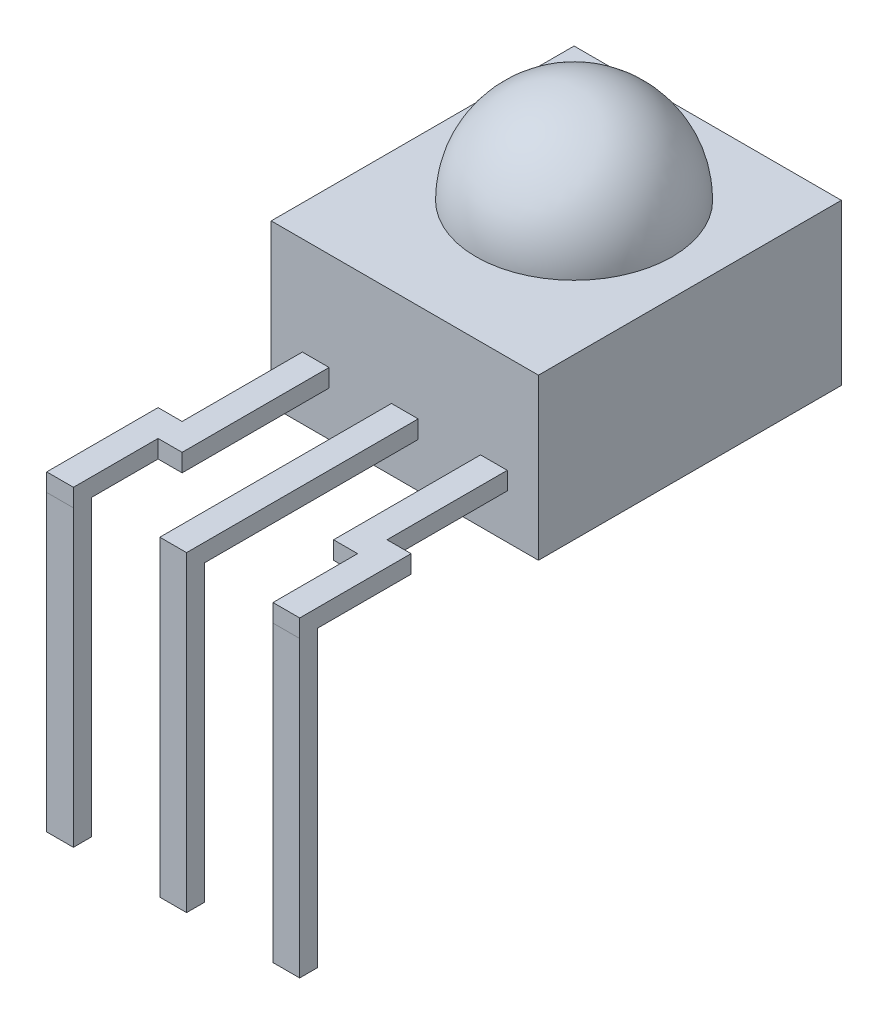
ISO-10303-21;
HEADER;
FILE_DESCRIPTION(('STEP AP214'),'2;1');
FILE_NAME('part.step','',(''),(''),'','','');
FILE_SCHEMA(('AUTOMOTIVE_DESIGN { 1 0 10303 214 1 1 1 1 }'));
ENDSEC;
DATA;
#1=APPLICATION_CONTEXT('core data for automotive mechanical design processes');
#2=APPLICATION_PROTOCOL_DEFINITION('international standard','automotive_design',2000,#1);
#3=PRODUCT_CONTEXT('',#1,'mechanical');
#4=PRODUCT('Part','Part','',(#3));
#5=PRODUCT_RELATED_PRODUCT_CATEGORY('part','',(#4));
#6=PRODUCT_DEFINITION_FORMATION('','',#4);
#7=PRODUCT_DEFINITION_CONTEXT('part definition',#1,'design');
#8=PRODUCT_DEFINITION('design','',#6,#7);
#9=PRODUCT_DEFINITION_SHAPE('','',#8);
#10=(LENGTH_UNIT() NAMED_UNIT(*) SI_UNIT(.MILLI.,.METRE.));
#11=(NAMED_UNIT(*) PLANE_ANGLE_UNIT() SI_UNIT($,.RADIAN.));
#12=(NAMED_UNIT(*) SI_UNIT($,.STERADIAN.) SOLID_ANGLE_UNIT());
#13=UNCERTAINTY_MEASURE_WITH_UNIT(LENGTH_MEASURE(1.E-05),#10,'distance_accuracy_value','');
#14=(GEOMETRIC_REPRESENTATION_CONTEXT(3) GLOBAL_UNCERTAINTY_ASSIGNED_CONTEXT((#13)) GLOBAL_UNIT_ASSIGNED_CONTEXT((#10,
#11,#12)) REPRESENTATION_CONTEXT('',''));
#15=CARTESIAN_POINT('',(0.,0.,0.));
#16=DIRECTION('',(0.,0.,1.));
#17=DIRECTION('',(1.,0.,0.));
#18=AXIS2_PLACEMENT_3D('',#15,#16,#17);
#19=CARTESIAN_POINT('',(-3.,2.4,0.));
#20=DIRECTION('',(0.,1.,0.));
#21=DIRECTION('',(0.,0.,1.));
#22=AXIS2_PLACEMENT_3D('',#19,#20,#21);
#23=PLANE('',#22);
#24=DIRECTION('',(0.,0.,1.));
#25=VECTOR('',#24,1.);
#26=CARTESIAN_POINT('',(-3.,2.4,-6.8));
#27=LINE('',#26,#25);
#28=CARTESIAN_POINT('',(-3.,2.4,-6.8));
#29=VERTEX_POINT('',#28);
#30=CARTESIAN_POINT('',(-3.,2.4,0.));
#31=VERTEX_POINT('',#30);
#32=EDGE_CURVE('E372',#29,#31,#27,.T.);
#33=ORIENTED_EDGE('',*,*,#32,.T.);
#34=DIRECTION('',(1.,0.,0.));
#35=VECTOR('',#34,1.);
#36=CARTESIAN_POINT('',(-3.,2.4,0.));
#37=LINE('',#36,#35);
#38=CARTESIAN_POINT('',(3.,2.4,0.));
#39=VERTEX_POINT('',#38);
#40=EDGE_CURVE('E370',#31,#39,#37,.T.);
#41=ORIENTED_EDGE('',*,*,#40,.T.);
#42=DIRECTION('',(0.,0.,-1.));
#43=VECTOR('',#42,1.);
#44=CARTESIAN_POINT('',(3.,2.4,-6.8));
#45=LINE('',#44,#43);
#46=CARTESIAN_POINT('',(3.,2.4,-6.8));
#47=VERTEX_POINT('',#46);
#48=EDGE_CURVE('E368',#39,#47,#45,.T.);
#49=ORIENTED_EDGE('',*,*,#48,.T.);
#50=DIRECTION('',(-1.,0.,0.));
#51=VECTOR('',#50,1.);
#52=CARTESIAN_POINT('',(-3.,2.4,-6.8));
#53=LINE('',#52,#51);
#54=EDGE_CURVE('E366',#47,#29,#53,.T.);
#55=ORIENTED_EDGE('',*,*,#54,.T.);
#56=EDGE_LOOP('',(#33,#41,#49,#55));
#57=FACE_BOUND('',#56,.T.);
#58=CARTESIAN_POINT('',(0.,2.4,-3.8));
#59=DIRECTION('',(0.,1.,0.));
#60=DIRECTION('',(0.,0.,1.));
#61=AXIS2_PLACEMENT_3D('',#58,#59,#60);
#62=CIRCLE('',#61,2.2);
#63=CARTESIAN_POINT('',(0.,2.4,-1.6));
#64=VERTEX_POINT('',#63);
#65=EDGE_CURVE('E829',#64,#64,#62,.T.);
#66=ORIENTED_EDGE('',*,*,#65,.F.);
#67=EDGE_LOOP('',(#66));
#68=FACE_BOUND('',#67,.T.);
#69=ADVANCED_FACE('F38',(#57,#68),#23,.T.);
#70=CARTESIAN_POINT('',(-2.3,-0.2,3.7211102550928));
#71=DIRECTION('',(0.,1.,0.));
#72=DIRECTION('',(0.,0.,1.));
#73=AXIS2_PLACEMENT_3D('',#70,#71,#72);
#74=PLANE('',#73);
#75=DIRECTION('',(1.,0.,0.));
#76=VECTOR('',#75,1.);
#77=CARTESIAN_POINT('',(-2.84,-0.2,4.7976308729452));
#78=LINE('',#77,#76);
#79=CARTESIAN_POINT('',(-2.84,-0.2,4.7976308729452));
#80=VERTEX_POINT('',#79);
#81=CARTESIAN_POINT('',(-2.24,-0.2,4.7976308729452));
#82=VERTEX_POINT('',#81);
#83=EDGE_CURVE('E281',#80,#82,#78,.T.);
#84=ORIENTED_EDGE('',*,*,#83,.F.);
#85=DIRECTION('',(0.,0.,1.));
#86=VECTOR('',#85,1.);
#87=CARTESIAN_POINT('',(-2.84,-0.2,2.7));
#88=LINE('',#87,#86);
#89=CARTESIAN_POINT('',(-2.84,-0.2,2.7));
#90=VERTEX_POINT('',#89);
#91=EDGE_CURVE('E286',#90,#80,#88,.T.);
#92=ORIENTED_EDGE('',*,*,#91,.F.);
#93=DIRECTION('',(-1.,0.,0.));
#94=VECTOR('',#93,1.);
#95=CARTESIAN_POINT('',(-2.3,-0.2,2.7));
#96=LINE('',#95,#94);
#97=CARTESIAN_POINT('',(-2.3,-0.2,2.7));
#98=VERTEX_POINT('',#97);
#99=EDGE_CURVE('E337',#98,#90,#96,.T.);
#100=ORIENTED_EDGE('',*,*,#99,.F.);
#101=DIRECTION('',(0.,0.,-1.));
#102=VECTOR('',#101,1.);
#103=CARTESIAN_POINT('',(-2.3,-0.2,3.7211102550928));
#104=LINE('',#103,#102);
#105=CARTESIAN_POINT('',(-2.3,-0.2,0.));
#106=VERTEX_POINT('',#105);
#107=EDGE_CURVE('E325',#98,#106,#104,.T.);
#108=ORIENTED_EDGE('',*,*,#107,.T.);
#109=DIRECTION('',(1.,0.,0.));
#110=VECTOR('',#109,1.);
#111=CARTESIAN_POINT('',(-2.3,-0.2,0.));
#112=LINE('',#111,#110);
#113=CARTESIAN_POINT('',(-1.7,-0.2,0.));
#114=VERTEX_POINT('',#113);
#115=EDGE_CURVE('E300',#106,#114,#112,.T.);
#116=ORIENTED_EDGE('',*,*,#115,.T.);
#117=DIRECTION('',(0.,0.,-1.));
#118=VECTOR('',#117,1.);
#119=CARTESIAN_POINT('',(-1.7,-0.2,3.7211102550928));
#120=LINE('',#119,#118);
#121=CARTESIAN_POINT('',(-1.7,-0.2,3.3));
#122=VERTEX_POINT('',#121);
#123=EDGE_CURVE('E322',#122,#114,#120,.T.);
#124=ORIENTED_EDGE('',*,*,#123,.F.);
#125=DIRECTION('',(-1.,0.,0.));
#126=VECTOR('',#125,1.);
#127=CARTESIAN_POINT('',(-1.7,-0.2,3.3));
#128=LINE('',#127,#126);
#129=CARTESIAN_POINT('',(-2.24,-0.2,3.3));
#130=VERTEX_POINT('',#129);
#131=EDGE_CURVE('E334',#122,#130,#128,.T.);
#132=ORIENTED_EDGE('',*,*,#131,.T.);
#133=DIRECTION('',(0.,0.,1.));
#134=VECTOR('',#133,1.);
#135=CARTESIAN_POINT('',(-2.24,-0.2,3.3));
#136=LINE('',#135,#134);
#137=EDGE_CURVE('E353',#130,#82,#136,.T.);
#138=ORIENTED_EDGE('',*,*,#137,.T.);
#139=EDGE_LOOP('',(#84,#92,#100,#108,#116,#124,#132,#138));
#140=FACE_BOUND('',#139,.T.);
#141=ADVANCED_FACE('F460',(#140),#74,.F.);
#142=CARTESIAN_POINT('',(-3.,2.4,0.));
#143=DIRECTION('',(0.,0.,-1.));
#144=DIRECTION('',(-1.,0.,0.));
#145=AXIS2_PLACEMENT_3D('',#142,#143,#144);
#146=PLANE('',#145);
#147=DIRECTION('',(1.,0.,0.));
#148=VECTOR('',#147,1.);
#149=CARTESIAN_POINT('',(2.3,0.2,0.));
#150=LINE('',#149,#148);
#151=CARTESIAN_POINT('',(1.7,0.2,0.));
#152=VERTEX_POINT('',#151);
#153=CARTESIAN_POINT('',(2.3,0.2,0.));
#154=VERTEX_POINT('',#153);
#155=EDGE_CURVE('E532',#152,#154,#150,.T.);
#156=ORIENTED_EDGE('',*,*,#155,.T.);
#157=DIRECTION('',(0.,-1.,0.));
#158=VECTOR('',#157,1.);
#159=CARTESIAN_POINT('',(2.3,0.2,0.));
#160=LINE('',#159,#158);
#161=CARTESIAN_POINT('',(2.3,-0.2,0.));
#162=VERTEX_POINT('',#161);
#163=EDGE_CURVE('E847',#154,#162,#160,.T.);
#164=ORIENTED_EDGE('',*,*,#163,.T.);
#165=DIRECTION('',(-1.,0.,0.));
#166=VECTOR('',#165,1.);
#167=CARTESIAN_POINT('',(2.3,-0.2,0.));
#168=LINE('',#167,#166);
#169=CARTESIAN_POINT('',(1.7,-0.2,0.));
#170=VERTEX_POINT('',#169);
#171=EDGE_CURVE('E867',#162,#170,#168,.T.);
#172=ORIENTED_EDGE('',*,*,#171,.T.);
#173=DIRECTION('',(0.,1.,0.));
#174=VECTOR('',#173,1.);
#175=CARTESIAN_POINT('',(1.7,0.2,0.));
#176=LINE('',#175,#174);
#177=EDGE_CURVE('E865',#170,#152,#176,.T.);
#178=ORIENTED_EDGE('',*,*,#177,.T.);
#179=EDGE_LOOP('',(#156,#164,#172,#178));
#180=FACE_BOUND('',#179,.T.);
#181=DIRECTION('',(0.,-1.,0.));
#182=VECTOR('',#181,1.);
#183=CARTESIAN_POINT('',(-0.3,-0.2,0.));
#184=LINE('',#183,#182);
#185=CARTESIAN_POINT('',(-0.3,0.2,0.));
#186=VERTEX_POINT('',#185);
#187=CARTESIAN_POINT('',(-0.3,-0.2,0.));
#188=VERTEX_POINT('',#187);
#189=EDGE_CURVE('E424',#186,#188,#184,.T.);
#190=ORIENTED_EDGE('',*,*,#189,.F.);
#191=DIRECTION('',(-1.,0.,0.));
#192=VECTOR('',#191,1.);
#193=CARTESIAN_POINT('',(-0.3,0.2,0.));
#194=LINE('',#193,#192);
#195=CARTESIAN_POINT('',(0.3,0.2,0.));
#196=VERTEX_POINT('',#195);
#197=EDGE_CURVE('E415',#196,#186,#194,.T.);
#198=ORIENTED_EDGE('',*,*,#197,.F.);
#199=DIRECTION('',(0.,1.,0.));
#200=VECTOR('',#199,1.);
#201=CARTESIAN_POINT('',(0.3,-0.2,0.));
#202=LINE('',#201,#200);
#203=CARTESIAN_POINT('',(0.3,-0.2,0.));
#204=VERTEX_POINT('',#203);
#205=EDGE_CURVE('E418',#204,#196,#202,.T.);
#206=ORIENTED_EDGE('',*,*,#205,.F.);
#207=DIRECTION('',(1.,0.,0.));
#208=VECTOR('',#207,1.);
#209=CARTESIAN_POINT('',(-0.3,-0.2,0.));
#210=LINE('',#209,#208);
#211=EDGE_CURVE('E421',#188,#204,#210,.T.);
#212=ORIENTED_EDGE('',*,*,#211,.F.);
#213=EDGE_LOOP('',(#190,#198,#206,#212));
#214=FACE_BOUND('',#213,.T.);
#215=DIRECTION('',(1.,0.,0.));
#216=VECTOR('',#215,1.);
#217=CARTESIAN_POINT('',(-3.,-1.2,0.));
#218=LINE('',#217,#216);
#219=CARTESIAN_POINT('',(-3.,-1.2,0.));
#220=VERTEX_POINT('',#219);
#221=CARTESIAN_POINT('',(3.,-1.2,0.));
#222=VERTEX_POINT('',#221);
#223=EDGE_CURVE('E379',#220,#222,#218,.T.);
#224=ORIENTED_EDGE('',*,*,#223,.T.);
#225=DIRECTION('',(0.,-1.,0.));
#226=VECTOR('',#225,1.);
#227=CARTESIAN_POINT('',(3.,2.4,0.));
#228=LINE('',#227,#226);
#229=EDGE_CURVE('E47',#39,#222,#228,.T.);
#230=ORIENTED_EDGE('',*,*,#229,.F.);
#231=ORIENTED_EDGE('',*,*,#40,.F.);
#232=DIRECTION('',(0.,-1.,0.));
#233=VECTOR('',#232,1.);
#234=CARTESIAN_POINT('',(-3.,2.4,0.));
#235=LINE('',#234,#233);
#236=EDGE_CURVE('E12',#31,#220,#235,.T.);
#237=ORIENTED_EDGE('',*,*,#236,.T.);
#238=EDGE_LOOP('',(#224,#230,#231,#237));
#239=FACE_BOUND('',#238,.T.);
#240=DIRECTION('',(0.,-1.,0.));
#241=VECTOR('',#240,1.);
#242=CARTESIAN_POINT('',(-2.3,0.2,0.));
#243=LINE('',#242,#241);
#244=CARTESIAN_POINT('',(-2.3,0.2,0.));
#245=VERTEX_POINT('',#244);
#246=EDGE_CURVE('E296',#245,#106,#243,.T.);
#247=ORIENTED_EDGE('',*,*,#246,.F.);
#248=DIRECTION('',(-1.,0.,0.));
#249=VECTOR('',#248,1.);
#250=CARTESIAN_POINT('',(-2.3,0.2,0.));
#251=LINE('',#250,#249);
#252=CARTESIAN_POINT('',(-1.7,0.2,0.));
#253=VERTEX_POINT('',#252);
#254=EDGE_CURVE('E314',#253,#245,#251,.T.);
#255=ORIENTED_EDGE('',*,*,#254,.F.);
#256=DIRECTION('',(0.,1.,0.));
#257=VECTOR('',#256,1.);
#258=CARTESIAN_POINT('',(-1.7,0.2,0.));
#259=LINE('',#258,#257);
#260=EDGE_CURVE('E306',#114,#253,#259,.T.);
#261=ORIENTED_EDGE('',*,*,#260,.F.);
#262=ORIENTED_EDGE('',*,*,#115,.F.);
#263=EDGE_LOOP('',(#247,#255,#261,#262));
#264=FACE_BOUND('',#263,.T.);
#265=ADVANCED_FACE('F507',(#180,#214,#239,#264),#146,.F.);
#266=CARTESIAN_POINT('',(-3.,2.4,-6.8));
#267=DIRECTION('',(1.,0.,0.));
#268=DIRECTION('',(0.,0.,-1.));
#269=AXIS2_PLACEMENT_3D('',#266,#267,#268);
#270=PLANE('',#269);
#271=DIRECTION('',(0.,0.,1.));
#272=VECTOR('',#271,1.);
#273=CARTESIAN_POINT('',(-3.,-1.2,-6.8));
#274=LINE('',#273,#272);
#275=CARTESIAN_POINT('',(-3.,-1.2,-6.8));
#276=VERTEX_POINT('',#275);
#277=EDGE_CURVE('E381',#276,#220,#274,.T.);
#278=ORIENTED_EDGE('',*,*,#277,.T.);
#279=ORIENTED_EDGE('',*,*,#236,.F.);
#280=ORIENTED_EDGE('',*,*,#32,.F.);
#281=DIRECTION('',(0.,-1.,0.));
#282=VECTOR('',#281,1.);
#283=CARTESIAN_POINT('',(-3.,2.4,-6.8));
#284=LINE('',#283,#282);
#285=EDGE_CURVE('E363',#29,#276,#284,.T.);
#286=ORIENTED_EDGE('',*,*,#285,.T.);
#287=EDGE_LOOP('',(#278,#279,#280,#286));
#288=FACE_BOUND('',#287,.T.);
#289=ADVANCED_FACE('F40',(#288),#270,.F.);
#290=CARTESIAN_POINT('',(3.,2.4,-6.8));
#291=DIRECTION('',(-1.,0.,0.));
#292=DIRECTION('',(0.,0.,1.));
#293=AXIS2_PLACEMENT_3D('',#290,#291,#292);
#294=PLANE('',#293);
#295=DIRECTION('',(0.,0.,-1.));
#296=VECTOR('',#295,1.);
#297=CARTESIAN_POINT('',(3.,-1.2,-6.8));
#298=LINE('',#297,#296);
#299=CARTESIAN_POINT('',(3.,-1.2,-6.8));
#300=VERTEX_POINT('',#299);
#301=EDGE_CURVE('E377',#222,#300,#298,.T.);
#302=ORIENTED_EDGE('',*,*,#301,.T.);
#303=DIRECTION('',(0.,-1.,0.));
#304=VECTOR('',#303,1.);
#305=CARTESIAN_POINT('',(3.,2.4,-6.8));
#306=LINE('',#305,#304);
#307=EDGE_CURVE('E360',#47,#300,#306,.T.);
#308=ORIENTED_EDGE('',*,*,#307,.F.);
#309=ORIENTED_EDGE('',*,*,#48,.F.);
#310=ORIENTED_EDGE('',*,*,#229,.T.);
#311=EDGE_LOOP('',(#302,#308,#309,#310));
#312=FACE_BOUND('',#311,.T.);
#313=ADVANCED_FACE('F517',(#312),#294,.F.);
#314=CARTESIAN_POINT('',(-3.,2.4,-6.8));
#315=DIRECTION('',(0.,0.,1.));
#316=DIRECTION('',(1.,0.,0.));
#317=AXIS2_PLACEMENT_3D('',#314,#315,#316);
#318=PLANE('',#317);
#319=DIRECTION('',(-1.,0.,0.));
#320=VECTOR('',#319,1.);
#321=CARTESIAN_POINT('',(-3.,-1.2,-6.8));
#322=LINE('',#321,#320);
#323=EDGE_CURVE('E375',#300,#276,#322,.T.);
#324=ORIENTED_EDGE('',*,*,#323,.T.);
#325=ORIENTED_EDGE('',*,*,#285,.F.);
#326=ORIENTED_EDGE('',*,*,#54,.F.);
#327=ORIENTED_EDGE('',*,*,#307,.T.);
#328=EDGE_LOOP('',(#324,#325,#326,#327));
#329=FACE_BOUND('',#328,.T.);
#330=ADVANCED_FACE('F514',(#329),#318,.F.);
#331=CARTESIAN_POINT('',(-3.,-1.2,0.));
#332=DIRECTION('',(0.,1.,0.));
#333=DIRECTION('',(0.,0.,1.));
#334=AXIS2_PLACEMENT_3D('',#331,#332,#333);
#335=PLANE('',#334);
#336=ORIENTED_EDGE('',*,*,#277,.F.);
#337=ORIENTED_EDGE('',*,*,#323,.F.);
#338=ORIENTED_EDGE('',*,*,#301,.F.);
#339=ORIENTED_EDGE('',*,*,#223,.F.);
#340=EDGE_LOOP('',(#336,#337,#338,#339));
#341=FACE_BOUND('',#340,.T.);
#342=ADVANCED_FACE('F512',(#341),#335,.F.);
#343=CARTESIAN_POINT('',(-0.3,-0.2,4.8));
#344=DIRECTION('',(0.,0.,-1.));
#345=DIRECTION('',(-1.,0.,0.));
#346=AXIS2_PLACEMENT_3D('',#343,#344,#345);
#347=PLANE('',#346);
#348=DIRECTION('',(0.,-1.,0.));
#349=VECTOR('',#348,1.);
#350=CARTESIAN_POINT('',(0.3,-0.2,4.8));
#351=LINE('',#350,#349);
#352=CARTESIAN_POINT('',(0.3,-0.2,4.8));
#353=VERTEX_POINT('',#352);
#354=CARTESIAN_POINT('',(0.3,-6.8,4.8));
#355=VERTEX_POINT('',#354);
#356=EDGE_CURVE('E389',#353,#355,#351,.T.);
#357=ORIENTED_EDGE('',*,*,#356,.T.);
#358=DIRECTION('',(-1.,0.,0.));
#359=VECTOR('',#358,1.);
#360=CARTESIAN_POINT('',(-0.3,-6.8,4.8));
#361=LINE('',#360,#359);
#362=CARTESIAN_POINT('',(-0.3,-6.8,4.8));
#363=VERTEX_POINT('',#362);
#364=EDGE_CURVE('E388',#355,#363,#361,.T.);
#365=ORIENTED_EDGE('',*,*,#364,.T.);
#366=DIRECTION('',(0.,-1.,0.));
#367=VECTOR('',#366,1.);
#368=CARTESIAN_POINT('',(-0.3,-0.2,4.8));
#369=LINE('',#368,#367);
#370=CARTESIAN_POINT('',(-0.3,-0.2,4.8));
#371=VERTEX_POINT('',#370);
#372=EDGE_CURVE('E398',#371,#363,#369,.T.);
#373=ORIENTED_EDGE('',*,*,#372,.F.);
#374=DIRECTION('',(1.,0.,0.));
#375=VECTOR('',#374,1.);
#376=CARTESIAN_POINT('',(-0.3,-0.2,4.8));
#377=LINE('',#376,#375);
#378=EDGE_CURVE('E401',#371,#353,#377,.T.);
#379=ORIENTED_EDGE('',*,*,#378,.T.);
#380=EDGE_LOOP('',(#357,#365,#373,#379));
#381=FACE_BOUND('',#380,.T.);
#382=ADVANCED_FACE('F575',(#381),#347,.T.);
#383=CARTESIAN_POINT('',(-0.3,0.2,5.2));
#384=DIRECTION('',(0.,0.,1.));
#385=DIRECTION('',(1.,0.,0.));
#386=AXIS2_PLACEMENT_3D('',#383,#384,#385);
#387=PLANE('',#386);
#388=DIRECTION('',(0.,-1.,0.));
#389=VECTOR('',#388,1.);
#390=CARTESIAN_POINT('',(-0.3,0.2,5.2));
#391=LINE('',#390,#389);
#392=CARTESIAN_POINT('',(-0.3,0.2,5.2));
#393=VERTEX_POINT('',#392);
#394=CARTESIAN_POINT('',(-0.3,-6.8,5.2));
#395=VERTEX_POINT('',#394);
#396=EDGE_CURVE('E395',#393,#395,#391,.T.);
#397=ORIENTED_EDGE('',*,*,#396,.T.);
#398=DIRECTION('',(1.,0.,0.));
#399=VECTOR('',#398,1.);
#400=CARTESIAN_POINT('',(-0.3,-6.8,5.2));
#401=LINE('',#400,#399);
#402=CARTESIAN_POINT('',(0.3,-6.8,5.2));
#403=VERTEX_POINT('',#402);
#404=EDGE_CURVE('E384',#395,#403,#401,.T.);
#405=ORIENTED_EDGE('',*,*,#404,.T.);
#406=DIRECTION('',(0.,-1.,0.));
#407=VECTOR('',#406,1.);
#408=CARTESIAN_POINT('',(0.3,0.2,5.2));
#409=LINE('',#408,#407);
#410=CARTESIAN_POINT('',(0.3,0.2,5.2));
#411=VERTEX_POINT('',#410);
#412=EDGE_CURVE('E392',#411,#403,#409,.T.);
#413=ORIENTED_EDGE('',*,*,#412,.F.);
#414=DIRECTION('',(-1.,0.,0.));
#415=VECTOR('',#414,1.);
#416=CARTESIAN_POINT('',(-0.3,0.2,5.2));
#417=LINE('',#416,#415);
#418=EDGE_CURVE('E405',#411,#393,#417,.T.);
#419=ORIENTED_EDGE('',*,*,#418,.T.);
#420=EDGE_LOOP('',(#397,#405,#413,#419));
#421=FACE_BOUND('',#420,.T.);
#422=ADVANCED_FACE('F570',(#421),#387,.T.);
#423=CARTESIAN_POINT('',(-0.3,-0.2,5.7211102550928));
#424=DIRECTION('',(0.,1.,0.));
#425=DIRECTION('',(0.,0.,1.));
#426=AXIS2_PLACEMENT_3D('',#423,#424,#425);
#427=PLANE('',#426);
#428=ORIENTED_EDGE('',*,*,#378,.F.);
#429=DIRECTION('',(0.,0.,-1.));
#430=VECTOR('',#429,1.);
#431=CARTESIAN_POINT('',(-0.3,-0.2,5.7211102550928));
#432=LINE('',#431,#430);
#433=EDGE_CURVE('E402',#371,#188,#432,.T.);
#434=ORIENTED_EDGE('',*,*,#433,.T.);
#435=ORIENTED_EDGE('',*,*,#211,.T.);
#436=DIRECTION('',(0.,0.,-1.));
#437=VECTOR('',#436,1.);
#438=CARTESIAN_POINT('',(0.3,-0.2,5.7211102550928));
#439=LINE('',#438,#437);
#440=EDGE_CURVE('E406',#353,#204,#439,.T.);
#441=ORIENTED_EDGE('',*,*,#440,.F.);
#442=EDGE_LOOP('',(#428,#434,#435,#441));
#443=FACE_BOUND('',#442,.T.);
#444=ADVANCED_FACE('F566',(#443),#427,.F.);
#445=CARTESIAN_POINT('',(0.3,-0.2,5.7211102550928));
#446=DIRECTION('',(-1.,0.,0.));
#447=DIRECTION('',(0.,0.,1.));
#448=AXIS2_PLACEMENT_3D('',#445,#446,#447);
#449=PLANE('',#448);
#450=DIRECTION('',(0.,0.,-1.));
#451=VECTOR('',#450,1.);
#452=CARTESIAN_POINT('',(0.3,0.2,5.7211102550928));
#453=LINE('',#452,#451);
#454=EDGE_CURVE('E409',#411,#196,#453,.T.);
#455=ORIENTED_EDGE('',*,*,#454,.F.);
#456=ORIENTED_EDGE('',*,*,#412,.T.);
#457=DIRECTION('',(0.,0.,-1.));
#458=VECTOR('',#457,1.);
#459=CARTESIAN_POINT('',(0.3,-6.8,5.2605551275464));
#460=LINE('',#459,#458);
#461=EDGE_CURVE('E385',#403,#355,#460,.T.);
#462=ORIENTED_EDGE('',*,*,#461,.T.);
#463=ORIENTED_EDGE('',*,*,#356,.F.);
#464=ORIENTED_EDGE('',*,*,#440,.T.);
#465=ORIENTED_EDGE('',*,*,#205,.T.);
#466=EDGE_LOOP('',(#455,#456,#462,#463,#464,#465));
#467=FACE_BOUND('',#466,.T.);
#468=ADVANCED_FACE('F562',(#467),#449,.F.);
#469=CARTESIAN_POINT('',(-0.3,0.2,5.7211102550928));
#470=DIRECTION('',(0.,-1.,0.));
#471=DIRECTION('',(0.,0.,-1.));
#472=AXIS2_PLACEMENT_3D('',#469,#470,#471);
#473=PLANE('',#472);
#474=ORIENTED_EDGE('',*,*,#418,.F.);
#475=ORIENTED_EDGE('',*,*,#454,.T.);
#476=ORIENTED_EDGE('',*,*,#197,.T.);
#477=DIRECTION('',(0.,0.,-1.));
#478=VECTOR('',#477,1.);
#479=CARTESIAN_POINT('',(-0.3,0.2,5.7211102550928));
#480=LINE('',#479,#478);
#481=EDGE_CURVE('E412',#393,#186,#480,.T.);
#482=ORIENTED_EDGE('',*,*,#481,.F.);
#483=EDGE_LOOP('',(#474,#475,#476,#482));
#484=FACE_BOUND('',#483,.T.);
#485=ADVANCED_FACE('F559',(#484),#473,.F.);
#486=CARTESIAN_POINT('',(-0.3,-0.2,5.7211102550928));
#487=DIRECTION('',(1.,0.,0.));
#488=DIRECTION('',(0.,0.,-1.));
#489=AXIS2_PLACEMENT_3D('',#486,#487,#488);
#490=PLANE('',#489);
#491=ORIENTED_EDGE('',*,*,#433,.F.);
#492=ORIENTED_EDGE('',*,*,#372,.T.);
#493=DIRECTION('',(0.,0.,1.));
#494=VECTOR('',#493,1.);
#495=CARTESIAN_POINT('',(-0.3,-6.8,5.2605551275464));
#496=LINE('',#495,#494);
#497=EDGE_CURVE('E434',#363,#395,#496,.T.);
#498=ORIENTED_EDGE('',*,*,#497,.T.);
#499=ORIENTED_EDGE('',*,*,#396,.F.);
#500=ORIENTED_EDGE('',*,*,#481,.T.);
#501=ORIENTED_EDGE('',*,*,#189,.T.);
#502=EDGE_LOOP('',(#491,#492,#498,#499,#500,#501));
#503=FACE_BOUND('',#502,.T.);
#504=ADVANCED_FACE('F557',(#503),#490,.F.);
#505=CARTESIAN_POINT('',(0.,-6.8,5.));
#506=DIRECTION('',(0.,-1.,0.));
#507=DIRECTION('',(0.,0.,-1.));
#508=AXIS2_PLACEMENT_3D('',#505,#506,#507);
#509=PLANE('',#508);
#510=ORIENTED_EDGE('',*,*,#461,.F.);
#511=ORIENTED_EDGE('',*,*,#404,.F.);
#512=ORIENTED_EDGE('',*,*,#497,.F.);
#513=ORIENTED_EDGE('',*,*,#364,.F.);
#514=EDGE_LOOP('',(#510,#511,#512,#513));
#515=FACE_BOUND('',#514,.T.);
#516=ADVANCED_FACE('F552',(#515),#509,.T.);
#517=CARTESIAN_POINT('',(-2.84,0.2,2.7));
#518=DIRECTION('',(1.,0.,0.));
#519=DIRECTION('',(0.,0.,-1.));
#520=AXIS2_PLACEMENT_3D('',#517,#518,#519);
#521=PLANE('',#520);
#522=DIRECTION('',(0.,-1.,0.));
#523=VECTOR('',#522,1.);
#524=CARTESIAN_POINT('',(-2.84,0.2,5.2));
#525=LINE('',#524,#523);
#526=CARTESIAN_POINT('',(-2.84,0.2,5.2));
#527=VERTEX_POINT('',#526);
#528=CARTESIAN_POINT('',(-2.84,-0.2,5.2));
#529=VERTEX_POINT('',#528);
#530=EDGE_CURVE('E438',#527,#529,#525,.T.);
#531=ORIENTED_EDGE('',*,*,#530,.F.);
#532=DIRECTION('',(0.,0.,1.));
#533=VECTOR('',#532,1.);
#534=CARTESIAN_POINT('',(-2.84,0.2,2.7));
#535=LINE('',#534,#533);
#536=CARTESIAN_POINT('',(-2.84,0.2,2.7));
#537=VERTEX_POINT('',#536);
#538=EDGE_CURVE('E347',#537,#527,#535,.T.);
#539=ORIENTED_EDGE('',*,*,#538,.F.);
#540=DIRECTION('',(0.,1.,0.));
#541=VECTOR('',#540,1.);
#542=CARTESIAN_POINT('',(-2.84,0.2,2.7));
#543=LINE('',#542,#541);
#544=EDGE_CURVE('E343',#90,#537,#543,.T.);
#545=ORIENTED_EDGE('',*,*,#544,.F.);
#546=ORIENTED_EDGE('',*,*,#91,.T.);
#547=DIRECTION('',(0.,0.999999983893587,-0.000179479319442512));
#548=VECTOR('',#547,1.);
#549=CARTESIAN_POINT('',(-2.84,-6.8,4.7988154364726));
#550=LINE('',#549,#548);
#551=CARTESIAN_POINT('',(-2.84,-6.8,4.7988154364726));
#552=VERTEX_POINT('',#551);
#553=EDGE_CURVE('E292',#552,#80,#550,.T.);
#554=ORIENTED_EDGE('',*,*,#553,.F.);
#555=DIRECTION('',(0.,0.,-1.));
#556=VECTOR('',#555,1.);
#557=CARTESIAN_POINT('',(-2.84,-6.8,5.2011845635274));
#558=LINE('',#557,#556);
#559=CARTESIAN_POINT('',(-2.84,-6.8,5.2011845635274));
#560=VERTEX_POINT('',#559);
#561=EDGE_CURVE('E278',#560,#552,#558,.T.);
#562=ORIENTED_EDGE('',*,*,#561,.F.);
#563=DIRECTION('',(0.,0.999999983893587,-0.000179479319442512));
#564=VECTOR('',#563,1.);
#565=CARTESIAN_POINT('',(-2.84,-6.8,5.2011845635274));
#566=LINE('',#565,#564);
#567=EDGE_CURVE('E475',#560,#529,#566,.T.);
#568=ORIENTED_EDGE('',*,*,#567,.T.);
#569=EDGE_LOOP('',(#531,#539,#545,#546,#554,#562,#568));
#570=FACE_BOUND('',#569,.T.);
#571=ADVANCED_FACE('F471',(#570),#521,.F.);
#572=CARTESIAN_POINT('',(-2.24,0.2,3.3));
#573=DIRECTION('',(-1.,0.,0.));
#574=DIRECTION('',(0.,0.,1.));
#575=AXIS2_PLACEMENT_3D('',#572,#573,#574);
#576=PLANE('',#575);
#577=DIRECTION('',(0.,1.,0.));
#578=VECTOR('',#577,1.);
#579=CARTESIAN_POINT('',(-2.24,0.2,5.2));
#580=LINE('',#579,#578);
#581=CARTESIAN_POINT('',(-2.24,-0.2,5.2));
#582=VERTEX_POINT('',#581);
#583=CARTESIAN_POINT('',(-2.24,0.2,5.2));
#584=VERTEX_POINT('',#583);
#585=EDGE_CURVE('E445',#582,#584,#580,.T.);
#586=ORIENTED_EDGE('',*,*,#585,.F.);
#587=DIRECTION('',(0.,0.999999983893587,-0.000179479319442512));
#588=VECTOR('',#587,1.);
#589=CARTESIAN_POINT('',(-2.24,-6.8,5.2011845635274));
#590=LINE('',#589,#588);
#591=CARTESIAN_POINT('',(-2.24,-6.8,5.2011845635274));
#592=VERTEX_POINT('',#591);
#593=EDGE_CURVE('E293',#592,#582,#590,.T.);
#594=ORIENTED_EDGE('',*,*,#593,.F.);
#595=DIRECTION('',(0.,0.,1.));
#596=VECTOR('',#595,1.);
#597=CARTESIAN_POINT('',(-2.24,-6.8,5.2011845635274));
#598=LINE('',#597,#596);
#599=CARTESIAN_POINT('',(-2.24,-6.8,4.7988154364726));
#600=VERTEX_POINT('',#599);
#601=EDGE_CURVE('E483',#600,#592,#598,.T.);
#602=ORIENTED_EDGE('',*,*,#601,.F.);
#603=DIRECTION('',(0.,0.999999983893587,-0.000179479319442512));
#604=VECTOR('',#603,1.);
#605=CARTESIAN_POINT('',(-2.24,-6.8,4.7988154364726));
#606=LINE('',#605,#604);
#607=EDGE_CURVE('E289',#600,#82,#606,.T.);
#608=ORIENTED_EDGE('',*,*,#607,.T.);
#609=ORIENTED_EDGE('',*,*,#137,.F.);
#610=DIRECTION('',(0.,-1.,0.));
#611=VECTOR('',#610,1.);
#612=CARTESIAN_POINT('',(-2.24,0.2,3.3));
#613=LINE('',#612,#611);
#614=CARTESIAN_POINT('',(-2.24,0.2,3.3));
#615=VERTEX_POINT('',#614);
#616=EDGE_CURVE('E346',#615,#130,#613,.T.);
#617=ORIENTED_EDGE('',*,*,#616,.F.);
#618=DIRECTION('',(0.,0.,1.));
#619=VECTOR('',#618,1.);
#620=CARTESIAN_POINT('',(-2.24,0.2,3.3));
#621=LINE('',#620,#619);
#622=EDGE_CURVE('E350',#615,#584,#621,.T.);
#623=ORIENTED_EDGE('',*,*,#622,.T.);
#624=EDGE_LOOP('',(#586,#594,#602,#608,#609,#617,#623));
#625=FACE_BOUND('',#624,.T.);
#626=ADVANCED_FACE('F455',(#625),#576,.F.);
#627=CARTESIAN_POINT('',(-1.7,0.2,3.3));
#628=DIRECTION('',(0.,0.,1.));
#629=DIRECTION('',(1.,0.,0.));
#630=AXIS2_PLACEMENT_3D('',#627,#628,#629);
#631=PLANE('',#630);
#632=DIRECTION('',(-1.,0.,0.));
#633=VECTOR('',#632,1.);
#634=CARTESIAN_POINT('',(-1.7,0.2,3.3));
#635=LINE('',#634,#633);
#636=CARTESIAN_POINT('',(-1.7,0.2,3.3));
#637=VERTEX_POINT('',#636);
#638=EDGE_CURVE('E331',#637,#615,#635,.T.);
#639=ORIENTED_EDGE('',*,*,#638,.T.);
#640=ORIENTED_EDGE('',*,*,#616,.T.);
#641=ORIENTED_EDGE('',*,*,#131,.F.);
#642=DIRECTION('',(0.,1.,0.));
#643=VECTOR('',#642,1.);
#644=CARTESIAN_POINT('',(-1.7,0.2,3.3));
#645=LINE('',#644,#643);
#646=EDGE_CURVE('E309',#122,#637,#645,.T.);
#647=ORIENTED_EDGE('',*,*,#646,.T.);
#648=EDGE_LOOP('',(#639,#640,#641,#647));
#649=FACE_BOUND('',#648,.T.);
#650=ADVANCED_FACE('F451',(#649),#631,.T.);
#651=CARTESIAN_POINT('',(-2.3,0.2,2.7));
#652=DIRECTION('',(0.,0.,-1.));
#653=DIRECTION('',(-1.,0.,0.));
#654=AXIS2_PLACEMENT_3D('',#651,#652,#653);
#655=PLANE('',#654);
#656=ORIENTED_EDGE('',*,*,#99,.T.);
#657=ORIENTED_EDGE('',*,*,#544,.T.);
#658=DIRECTION('',(-1.,0.,0.));
#659=VECTOR('',#658,1.);
#660=CARTESIAN_POINT('',(-2.3,0.2,2.7));
#661=LINE('',#660,#659);
#662=CARTESIAN_POINT('',(-2.3,0.2,2.7));
#663=VERTEX_POINT('',#662);
#664=EDGE_CURVE('E340',#663,#537,#661,.T.);
#665=ORIENTED_EDGE('',*,*,#664,.F.);
#666=DIRECTION('',(0.,-1.,0.));
#667=VECTOR('',#666,1.);
#668=CARTESIAN_POINT('',(-2.3,0.2,2.7));
#669=LINE('',#668,#667);
#670=EDGE_CURVE('E328',#663,#98,#669,.T.);
#671=ORIENTED_EDGE('',*,*,#670,.T.);
#672=EDGE_LOOP('',(#656,#657,#665,#671));
#673=FACE_BOUND('',#672,.T.);
#674=ADVANCED_FACE('F539',(#673),#655,.T.);
#675=CARTESIAN_POINT('',(-2.3,0.2,3.7211102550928));
#676=DIRECTION('',(0.,-1.,0.));
#677=DIRECTION('',(0.,0.,-1.));
#678=AXIS2_PLACEMENT_3D('',#675,#676,#677);
#679=PLANE('',#678);
#680=DIRECTION('',(0.,0.,-1.));
#681=VECTOR('',#680,1.);
#682=CARTESIAN_POINT('',(-2.3,0.2,3.7211102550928));
#683=LINE('',#682,#681);
#684=EDGE_CURVE('E317',#663,#245,#683,.T.);
#685=ORIENTED_EDGE('',*,*,#684,.F.);
#686=ORIENTED_EDGE('',*,*,#664,.T.);
#687=ORIENTED_EDGE('',*,*,#538,.T.);
#688=DIRECTION('',(-1.,0.,0.));
#689=VECTOR('',#688,1.);
#690=CARTESIAN_POINT('',(-2.0594448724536,0.2,5.2));
#691=LINE('',#690,#689);
#692=EDGE_CURVE('E442',#584,#527,#691,.T.);
#693=ORIENTED_EDGE('',*,*,#692,.F.);
#694=ORIENTED_EDGE('',*,*,#622,.F.);
#695=ORIENTED_EDGE('',*,*,#638,.F.);
#696=DIRECTION('',(0.,0.,-1.));
#697=VECTOR('',#696,1.);
#698=CARTESIAN_POINT('',(-1.7,0.2,3.7211102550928));
#699=LINE('',#698,#697);
#700=EDGE_CURVE('E319',#637,#253,#699,.T.);
#701=ORIENTED_EDGE('',*,*,#700,.T.);
#702=ORIENTED_EDGE('',*,*,#254,.T.);
#703=EDGE_LOOP('',(#685,#686,#687,#693,#694,#695,#701,#702));
#704=FACE_BOUND('',#703,.T.);
#705=ADVANCED_FACE('F466',(#704),#679,.F.);
#706=CARTESIAN_POINT('',(-1.7,0.2,3.7211102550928));
#707=DIRECTION('',(-1.,0.,0.));
#708=DIRECTION('',(0.,0.,1.));
#709=AXIS2_PLACEMENT_3D('',#706,#707,#708);
#710=PLANE('',#709);
#711=ORIENTED_EDGE('',*,*,#646,.F.);
#712=ORIENTED_EDGE('',*,*,#123,.T.);
#713=ORIENTED_EDGE('',*,*,#260,.T.);
#714=ORIENTED_EDGE('',*,*,#700,.F.);
#715=EDGE_LOOP('',(#711,#712,#713,#714));
#716=FACE_BOUND('',#715,.T.);
#717=ADVANCED_FACE('F462',(#716),#710,.F.);
#718=CARTESIAN_POINT('',(-2.3,0.2,3.7211102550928));
#719=DIRECTION('',(1.,0.,0.));
#720=DIRECTION('',(0.,0.,-1.));
#721=AXIS2_PLACEMENT_3D('',#718,#719,#720);
#722=PLANE('',#721);
#723=ORIENTED_EDGE('',*,*,#670,.F.);
#724=ORIENTED_EDGE('',*,*,#684,.T.);
#725=ORIENTED_EDGE('',*,*,#246,.T.);
#726=ORIENTED_EDGE('',*,*,#107,.F.);
#727=EDGE_LOOP('',(#723,#724,#725,#726));
#728=FACE_BOUND('',#727,.T.);
#729=ADVANCED_FACE('F537',(#728),#722,.F.);
#730=CARTESIAN_POINT('',(-2.54,0.,5.2));
#731=DIRECTION('',(0.,0.,1.));
#732=DIRECTION('',(1.,0.,0.));
#733=AXIS2_PLACEMENT_3D('',#730,#731,#732);
#734=PLANE('',#733);
#735=ORIENTED_EDGE('',*,*,#530,.T.);
#736=DIRECTION('',(1.,0.,0.));
#737=VECTOR('',#736,1.);
#738=CARTESIAN_POINT('',(-2.0594448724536,-0.2,5.2));
#739=LINE('',#738,#737);
#740=EDGE_CURVE('E427',#529,#582,#739,.T.);
#741=ORIENTED_EDGE('',*,*,#740,.T.);
#742=ORIENTED_EDGE('',*,*,#585,.T.);
#743=ORIENTED_EDGE('',*,*,#692,.T.);
#744=EDGE_LOOP('',(#735,#741,#742,#743));
#745=FACE_BOUND('',#744,.T.);
#746=ADVANCED_FACE('F468',(#745),#734,.T.);
#747=CARTESIAN_POINT('',(-2.84,-6.8,4.7988154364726));
#748=DIRECTION('',(0.,0.000179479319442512,0.999999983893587));
#749=DIRECTION('',(0.,-0.999999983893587,0.000179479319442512));
#750=AXIS2_PLACEMENT_3D('',#747,#748,#749);
#751=PLANE('',#750);
#752=ORIENTED_EDGE('',*,*,#83,.T.);
#753=ORIENTED_EDGE('',*,*,#607,.F.);
#754=DIRECTION('',(1.,0.,0.));
#755=VECTOR('',#754,1.);
#756=CARTESIAN_POINT('',(-2.84,-6.8,4.7988154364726));
#757=LINE('',#756,#755);
#758=EDGE_CURVE('E488',#552,#600,#757,.T.);
#759=ORIENTED_EDGE('',*,*,#758,.F.);
#760=ORIENTED_EDGE('',*,*,#553,.T.);
#761=EDGE_LOOP('',(#752,#753,#759,#760));
#762=FACE_BOUND('',#761,.T.);
#763=ADVANCED_FACE('F487',(#762),#751,.F.);
#764=CARTESIAN_POINT('',(-2.84,-6.8,5.2011845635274));
#765=DIRECTION('',(0.,-0.000179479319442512,-0.999999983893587));
#766=DIRECTION('',(0.,0.999999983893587,-0.000179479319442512));
#767=AXIS2_PLACEMENT_3D('',#764,#765,#766);
#768=PLANE('',#767);
#769=ORIENTED_EDGE('',*,*,#740,.F.);
#770=ORIENTED_EDGE('',*,*,#567,.F.);
#771=DIRECTION('',(-1.,0.,0.));
#772=VECTOR('',#771,1.);
#773=CARTESIAN_POINT('',(-2.84,-6.8,5.2011845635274));
#774=LINE('',#773,#772);
#775=EDGE_CURVE('E479',#592,#560,#774,.T.);
#776=ORIENTED_EDGE('',*,*,#775,.F.);
#777=ORIENTED_EDGE('',*,*,#593,.T.);
#778=EDGE_LOOP('',(#769,#770,#776,#777));
#779=FACE_BOUND('',#778,.T.);
#780=ADVANCED_FACE('F492',(#779),#768,.F.);
#781=CARTESIAN_POINT('',(-2.84,-6.8,4.7988154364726));
#782=DIRECTION('',(0.,-1.,0.));
#783=DIRECTION('',(0.,0.,-1.));
#784=AXIS2_PLACEMENT_3D('',#781,#782,#783);
#785=PLANE('',#784);
#786=ORIENTED_EDGE('',*,*,#561,.T.);
#787=ORIENTED_EDGE('',*,*,#758,.T.);
#788=ORIENTED_EDGE('',*,*,#601,.T.);
#789=ORIENTED_EDGE('',*,*,#775,.T.);
#790=EDGE_LOOP('',(#786,#787,#788,#789));
#791=FACE_BOUND('',#790,.T.);
#792=ADVANCED_FACE('F491',(#791),#785,.T.);
#793=CARTESIAN_POINT('',(2.24,0.2,3.3));
#794=DIRECTION('',(-1.,0.,0.));
#795=DIRECTION('',(0.,0.,1.));
#796=AXIS2_PLACEMENT_3D('',#793,#794,#795);
#797=PLANE('',#796);
#798=DIRECTION('',(0.,0.,1.));
#799=VECTOR('',#798,1.);
#800=CARTESIAN_POINT('',(2.24,-0.2,3.3));
#801=LINE('',#800,#799);
#802=CARTESIAN_POINT('',(2.24,-0.2,3.3));
#803=VERTEX_POINT('',#802);
#804=CARTESIAN_POINT('',(2.24,-0.2,4.7976308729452));
#805=VERTEX_POINT('',#804);
#806=EDGE_CURVE('E271',#803,#805,#801,.T.);
#807=ORIENTED_EDGE('',*,*,#806,.T.);
#808=DIRECTION('',(0.,0.999999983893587,-0.000179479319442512));
#809=VECTOR('',#808,1.);
#810=CARTESIAN_POINT('',(2.24,-6.8,4.7988154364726));
#811=LINE('',#810,#809);
#812=CARTESIAN_POINT('',(2.24,-6.8,4.7988154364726));
#813=VERTEX_POINT('',#812);
#814=EDGE_CURVE('E267',#813,#805,#811,.T.);
#815=ORIENTED_EDGE('',*,*,#814,.F.);
#816=DIRECTION('',(0.,0.,1.));
#817=VECTOR('',#816,1.);
#818=CARTESIAN_POINT('',(2.24,-6.8,5.2011845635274));
#819=LINE('',#818,#817);
#820=CARTESIAN_POINT('',(2.24,-6.8,5.2011845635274));
#821=VERTEX_POINT('',#820);
#822=EDGE_CURVE('E262',#813,#821,#819,.T.);
#823=ORIENTED_EDGE('',*,*,#822,.T.);
#824=DIRECTION('',(0.,0.999999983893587,-0.000179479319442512));
#825=VECTOR('',#824,1.);
#826=CARTESIAN_POINT('',(2.24,-6.8,5.2011845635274));
#827=LINE('',#826,#825);
#828=CARTESIAN_POINT('',(2.24,-0.2,5.2));
#829=VERTEX_POINT('',#828);
#830=EDGE_CURVE('E259',#821,#829,#827,.T.);
#831=ORIENTED_EDGE('',*,*,#830,.T.);
#832=DIRECTION('',(0.,1.,0.));
#833=VECTOR('',#832,1.);
#834=CARTESIAN_POINT('',(2.24,0.2,5.2));
#835=LINE('',#834,#833);
#836=CARTESIAN_POINT('',(2.24,0.2,5.2));
#837=VERTEX_POINT('',#836);
#838=EDGE_CURVE('E247',#829,#837,#835,.T.);
#839=ORIENTED_EDGE('',*,*,#838,.T.);
#840=DIRECTION('',(0.,0.,1.));
#841=VECTOR('',#840,1.);
#842=CARTESIAN_POINT('',(2.24,0.2,3.3));
#843=LINE('',#842,#841);
#844=CARTESIAN_POINT('',(2.24,0.2,3.3));
#845=VERTEX_POINT('',#844);
#846=EDGE_CURVE('E857',#845,#837,#843,.T.);
#847=ORIENTED_EDGE('',*,*,#846,.F.);
#848=DIRECTION('',(0.,-1.,0.));
#849=VECTOR('',#848,1.);
#850=CARTESIAN_POINT('',(2.24,0.2,3.3));
#851=LINE('',#850,#849);
#852=EDGE_CURVE('E853',#845,#803,#851,.T.);
#853=ORIENTED_EDGE('',*,*,#852,.T.);
#854=EDGE_LOOP('',(#807,#815,#823,#831,#839,#847,#853));
#855=FACE_BOUND('',#854,.T.);
#856=ADVANCED_FACE('F260',(#855),#797,.T.);
#857=CARTESIAN_POINT('',(2.84,0.2,2.7));
#858=DIRECTION('',(1.,0.,0.));
#859=DIRECTION('',(0.,0.,-1.));
#860=AXIS2_PLACEMENT_3D('',#857,#858,#859);
#861=PLANE('',#860);
#862=DIRECTION('',(0.,0.,1.));
#863=VECTOR('',#862,1.);
#864=CARTESIAN_POINT('',(2.84,0.2,2.7));
#865=LINE('',#864,#863);
#866=CARTESIAN_POINT('',(2.84,0.2,2.7));
#867=VERTEX_POINT('',#866);
#868=CARTESIAN_POINT('',(2.84,0.2,5.2));
#869=VERTEX_POINT('',#868);
#870=EDGE_CURVE('E891',#867,#869,#865,.T.);
#871=ORIENTED_EDGE('',*,*,#870,.T.);
#872=DIRECTION('',(0.,-1.,0.));
#873=VECTOR('',#872,1.);
#874=CARTESIAN_POINT('',(2.84,0.2,5.2));
#875=LINE('',#874,#873);
#876=CARTESIAN_POINT('',(2.84,-0.2,5.2));
#877=VERTEX_POINT('',#876);
#878=EDGE_CURVE('E285',#869,#877,#875,.T.);
#879=ORIENTED_EDGE('',*,*,#878,.T.);
#880=DIRECTION('',(0.,0.999999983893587,-0.000179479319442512));
#881=VECTOR('',#880,1.);
#882=CARTESIAN_POINT('',(2.84,-6.8,5.2011845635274));
#883=LINE('',#882,#881);
#884=CARTESIAN_POINT('',(2.84,-6.8,5.2011845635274));
#885=VERTEX_POINT('',#884);
#886=EDGE_CURVE('E266',#885,#877,#883,.T.);
#887=ORIENTED_EDGE('',*,*,#886,.F.);
#888=DIRECTION('',(0.,0.,-1.));
#889=VECTOR('',#888,1.);
#890=CARTESIAN_POINT('',(2.84,-6.8,5.2011845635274));
#891=LINE('',#890,#889);
#892=CARTESIAN_POINT('',(2.84,-6.8,4.7988154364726));
#893=VERTEX_POINT('',#892);
#894=EDGE_CURVE('E831',#885,#893,#891,.T.);
#895=ORIENTED_EDGE('',*,*,#894,.T.);
#896=DIRECTION('',(0.,0.999999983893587,-0.000179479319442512));
#897=VECTOR('',#896,1.);
#898=CARTESIAN_POINT('',(2.84,-6.8,4.7988154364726));
#899=LINE('',#898,#897);
#900=CARTESIAN_POINT('',(2.84,-0.2,4.7976308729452));
#901=VERTEX_POINT('',#900);
#902=EDGE_CURVE('E842',#893,#901,#899,.T.);
#903=ORIENTED_EDGE('',*,*,#902,.T.);
#904=DIRECTION('',(0.,0.,1.));
#905=VECTOR('',#904,1.);
#906=CARTESIAN_POINT('',(2.84,-0.2,2.7));
#907=LINE('',#906,#905);
#908=CARTESIAN_POINT('',(2.84,-0.2,2.7));
#909=VERTEX_POINT('',#908);
#910=EDGE_CURVE('E60',#909,#901,#907,.T.);
#911=ORIENTED_EDGE('',*,*,#910,.F.);
#912=DIRECTION('',(0.,1.,0.));
#913=VECTOR('',#912,1.);
#914=CARTESIAN_POINT('',(2.84,0.2,2.7));
#915=LINE('',#914,#913);
#916=EDGE_CURVE('E850',#909,#867,#915,.T.);
#917=ORIENTED_EDGE('',*,*,#916,.T.);
#918=EDGE_LOOP('',(#871,#879,#887,#895,#903,#911,#917));
#919=FACE_BOUND('',#918,.T.);
#920=ADVANCED_FACE('F698',(#919),#861,.T.);
#921=CARTESIAN_POINT('',(1.7,0.2,3.3));
#922=DIRECTION('',(0.,0.,-1.));
#923=DIRECTION('',(-1.,0.,0.));
#924=AXIS2_PLACEMENT_3D('',#921,#922,#923);
#925=PLANE('',#924);
#926=ORIENTED_EDGE('',*,*,#852,.F.);
#927=DIRECTION('',(1.,0.,0.));
#928=VECTOR('',#927,1.);
#929=CARTESIAN_POINT('',(1.7,0.2,3.3));
#930=LINE('',#929,#928);
#931=CARTESIAN_POINT('',(1.7,0.2,3.3));
#932=VERTEX_POINT('',#931);
#933=EDGE_CURVE('E861',#932,#845,#930,.T.);
#934=ORIENTED_EDGE('',*,*,#933,.F.);
#935=DIRECTION('',(0.,1.,0.));
#936=VECTOR('',#935,1.);
#937=CARTESIAN_POINT('',(1.7,0.2,3.3));
#938=LINE('',#937,#936);
#939=CARTESIAN_POINT('',(1.7,-0.2,3.3));
#940=VERTEX_POINT('',#939);
#941=EDGE_CURVE('E858',#940,#932,#938,.T.);
#942=ORIENTED_EDGE('',*,*,#941,.F.);
#943=DIRECTION('',(1.,0.,0.));
#944=VECTOR('',#943,1.);
#945=CARTESIAN_POINT('',(1.7,-0.2,3.3));
#946=LINE('',#945,#944);
#947=EDGE_CURVE('E854',#940,#803,#946,.T.);
#948=ORIENTED_EDGE('',*,*,#947,.T.);
#949=EDGE_LOOP('',(#926,#934,#942,#948));
#950=FACE_BOUND('',#949,.T.);
#951=ADVANCED_FACE('F709',(#950),#925,.F.);
#952=CARTESIAN_POINT('',(2.3,0.2,2.7));
#953=DIRECTION('',(0.,0.,1.));
#954=DIRECTION('',(1.,0.,0.));
#955=AXIS2_PLACEMENT_3D('',#952,#953,#954);
#956=PLANE('',#955);
#957=ORIENTED_EDGE('',*,*,#916,.F.);
#958=DIRECTION('',(1.,0.,0.));
#959=VECTOR('',#958,1.);
#960=CARTESIAN_POINT('',(2.3,-0.2,2.7));
#961=LINE('',#960,#959);
#962=CARTESIAN_POINT('',(2.3,-0.2,2.7));
#963=VERTEX_POINT('',#962);
#964=EDGE_CURVE('E886',#963,#909,#961,.T.);
#965=ORIENTED_EDGE('',*,*,#964,.F.);
#966=DIRECTION('',(0.,-1.,0.));
#967=VECTOR('',#966,1.);
#968=CARTESIAN_POINT('',(2.3,0.2,2.7));
#969=LINE('',#968,#967);
#970=CARTESIAN_POINT('',(2.3,0.2,2.7));
#971=VERTEX_POINT('',#970);
#972=EDGE_CURVE('E862',#971,#963,#969,.T.);
#973=ORIENTED_EDGE('',*,*,#972,.F.);
#974=DIRECTION('',(1.,0.,0.));
#975=VECTOR('',#974,1.);
#976=CARTESIAN_POINT('',(2.3,0.2,2.7));
#977=LINE('',#976,#975);
#978=EDGE_CURVE('E883',#971,#867,#977,.T.);
#979=ORIENTED_EDGE('',*,*,#978,.T.);
#980=EDGE_LOOP('',(#957,#965,#973,#979));
#981=FACE_BOUND('',#980,.T.);
#982=ADVANCED_FACE('F721',(#981),#956,.F.);
#983=CARTESIAN_POINT('',(2.3,0.2,3.7211102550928));
#984=DIRECTION('',(1.,0.,0.));
#985=DIRECTION('',(0.,0.,-1.));
#986=AXIS2_PLACEMENT_3D('',#983,#984,#985);
#987=PLANE('',#986);
#988=DIRECTION('',(0.,0.,-1.));
#989=VECTOR('',#988,1.);
#990=CARTESIAN_POINT('',(2.3,0.2,3.7211102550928));
#991=LINE('',#990,#989);
#992=EDGE_CURVE('E876',#971,#154,#991,.T.);
#993=ORIENTED_EDGE('',*,*,#992,.F.);
#994=ORIENTED_EDGE('',*,*,#972,.T.);
#995=DIRECTION('',(0.,0.,-1.));
#996=VECTOR('',#995,1.);
#997=CARTESIAN_POINT('',(2.3,-0.2,3.7211102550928));
#998=LINE('',#997,#996);
#999=EDGE_CURVE('E870',#963,#162,#998,.T.);
#1000=ORIENTED_EDGE('',*,*,#999,.T.);
#1001=ORIENTED_EDGE('',*,*,#163,.F.);
#1002=EDGE_LOOP('',(#993,#994,#1000,#1001));
#1003=FACE_BOUND('',#1002,.T.);
#1004=ADVANCED_FACE('F730',(#1003),#987,.T.);
#1005=CARTESIAN_POINT('',(2.3,-0.2,3.7211102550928));
#1006=DIRECTION('',(0.,-1.,0.));
#1007=DIRECTION('',(0.,0.,-1.));
#1008=AXIS2_PLACEMENT_3D('',#1005,#1006,#1007);
#1009=PLANE('',#1008);
#1010=DIRECTION('',(-1.,0.,0.));
#1011=VECTOR('',#1010,1.);
#1012=CARTESIAN_POINT('',(2.84,-0.2,4.7976308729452));
#1013=LINE('',#1012,#1011);
#1014=EDGE_CURVE('E55',#901,#805,#1013,.T.);
#1015=ORIENTED_EDGE('',*,*,#1014,.T.);
#1016=ORIENTED_EDGE('',*,*,#806,.F.);
#1017=ORIENTED_EDGE('',*,*,#947,.F.);
#1018=DIRECTION('',(0.,0.,-1.));
#1019=VECTOR('',#1018,1.);
#1020=CARTESIAN_POINT('',(1.7,-0.2,3.7211102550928));
#1021=LINE('',#1020,#1019);
#1022=EDGE_CURVE('E872',#940,#170,#1021,.T.);
#1023=ORIENTED_EDGE('',*,*,#1022,.T.);
#1024=ORIENTED_EDGE('',*,*,#171,.F.);
#1025=ORIENTED_EDGE('',*,*,#999,.F.);
#1026=ORIENTED_EDGE('',*,*,#964,.T.);
#1027=ORIENTED_EDGE('',*,*,#910,.T.);
#1028=EDGE_LOOP('',(#1015,#1016,#1017,#1023,#1024,#1025,#1026,#1027));
#1029=FACE_BOUND('',#1028,.T.);
#1030=ADVANCED_FACE('F739',(#1029),#1009,.T.);
#1031=CARTESIAN_POINT('',(1.7,0.2,3.7211102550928));
#1032=DIRECTION('',(-1.,0.,0.));
#1033=DIRECTION('',(0.,0.,1.));
#1034=AXIS2_PLACEMENT_3D('',#1031,#1032,#1033);
#1035=PLANE('',#1034);
#1036=ORIENTED_EDGE('',*,*,#1022,.F.);
#1037=ORIENTED_EDGE('',*,*,#941,.T.);
#1038=DIRECTION('',(0.,0.,-1.));
#1039=VECTOR('',#1038,1.);
#1040=CARTESIAN_POINT('',(1.7,0.2,3.7211102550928));
#1041=LINE('',#1040,#1039);
#1042=EDGE_CURVE('E874',#932,#152,#1041,.T.);
#1043=ORIENTED_EDGE('',*,*,#1042,.T.);
#1044=ORIENTED_EDGE('',*,*,#177,.F.);
#1045=EDGE_LOOP('',(#1036,#1037,#1043,#1044));
#1046=FACE_BOUND('',#1045,.T.);
#1047=ADVANCED_FACE('F748',(#1046),#1035,.T.);
#1048=CARTESIAN_POINT('',(2.3,0.2,3.7211102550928));
#1049=DIRECTION('',(0.,1.,0.));
#1050=DIRECTION('',(0.,0.,1.));
#1051=AXIS2_PLACEMENT_3D('',#1048,#1049,#1050);
#1052=PLANE('',#1051);
#1053=ORIENTED_EDGE('',*,*,#1042,.F.);
#1054=ORIENTED_EDGE('',*,*,#933,.T.);
#1055=ORIENTED_EDGE('',*,*,#846,.T.);
#1056=DIRECTION('',(1.,0.,0.));
#1057=VECTOR('',#1056,1.);
#1058=CARTESIAN_POINT('',(2.0594448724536,0.2,5.2));
#1059=LINE('',#1058,#1057);
#1060=EDGE_CURVE('E254',#837,#869,#1059,.T.);
#1061=ORIENTED_EDGE('',*,*,#1060,.T.);
#1062=ORIENTED_EDGE('',*,*,#870,.F.);
#1063=ORIENTED_EDGE('',*,*,#978,.F.);
#1064=ORIENTED_EDGE('',*,*,#992,.T.);
#1065=ORIENTED_EDGE('',*,*,#155,.F.);
#1066=EDGE_LOOP('',(#1053,#1054,#1055,#1061,#1062,#1063,#1064,#1065));
#1067=FACE_BOUND('',#1066,.T.);
#1068=ADVANCED_FACE('F762',(#1067),#1052,.T.);
#1069=CARTESIAN_POINT('',(2.54,0.,5.2));
#1070=DIRECTION('',(0.,0.,1.));
#1071=DIRECTION('',(1.,0.,0.));
#1072=AXIS2_PLACEMENT_3D('',#1069,#1070,#1071);
#1073=PLANE('',#1072);
#1074=DIRECTION('',(-1.,0.,0.));
#1075=VECTOR('',#1074,1.);
#1076=CARTESIAN_POINT('',(2.0594448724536,-0.2,5.2));
#1077=LINE('',#1076,#1075);
#1078=EDGE_CURVE('E251',#877,#829,#1077,.T.);
#1079=ORIENTED_EDGE('',*,*,#1078,.F.);
#1080=ORIENTED_EDGE('',*,*,#878,.F.);
#1081=ORIENTED_EDGE('',*,*,#1060,.F.);
#1082=ORIENTED_EDGE('',*,*,#838,.F.);
#1083=EDGE_LOOP('',(#1079,#1080,#1081,#1082));
#1084=FACE_BOUND('',#1083,.T.);
#1085=ADVANCED_FACE('F249',(#1084),#1073,.T.);
#1086=CARTESIAN_POINT('',(2.84,-6.8,5.2011845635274));
#1087=DIRECTION('',(0.,0.000179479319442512,0.999999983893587));
#1088=DIRECTION('',(0.,-0.999999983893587,0.000179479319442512));
#1089=AXIS2_PLACEMENT_3D('',#1086,#1087,#1088);
#1090=PLANE('',#1089);
#1091=ORIENTED_EDGE('',*,*,#1078,.T.);
#1092=ORIENTED_EDGE('',*,*,#830,.F.);
#1093=DIRECTION('',(1.,0.,0.));
#1094=VECTOR('',#1093,1.);
#1095=CARTESIAN_POINT('',(2.84,-6.8,5.2011845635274));
#1096=LINE('',#1095,#1094);
#1097=EDGE_CURVE('E836',#821,#885,#1096,.T.);
#1098=ORIENTED_EDGE('',*,*,#1097,.T.);
#1099=ORIENTED_EDGE('',*,*,#886,.T.);
#1100=EDGE_LOOP('',(#1091,#1092,#1098,#1099));
#1101=FACE_BOUND('',#1100,.T.);
#1102=ADVANCED_FACE('F270',(#1101),#1090,.T.);
#1103=CARTESIAN_POINT('',(2.84,-6.8,4.7988154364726));
#1104=DIRECTION('',(0.,-0.000179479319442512,-0.999999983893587));
#1105=DIRECTION('',(0.,0.999999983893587,-0.000179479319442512));
#1106=AXIS2_PLACEMENT_3D('',#1103,#1104,#1105);
#1107=PLANE('',#1106);
#1108=ORIENTED_EDGE('',*,*,#1014,.F.);
#1109=ORIENTED_EDGE('',*,*,#902,.F.);
#1110=DIRECTION('',(-1.,0.,0.));
#1111=VECTOR('',#1110,1.);
#1112=CARTESIAN_POINT('',(2.84,-6.8,4.7988154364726));
#1113=LINE('',#1112,#1111);
#1114=EDGE_CURVE('E839',#893,#813,#1113,.T.);
#1115=ORIENTED_EDGE('',*,*,#1114,.T.);
#1116=ORIENTED_EDGE('',*,*,#814,.T.);
#1117=EDGE_LOOP('',(#1108,#1109,#1115,#1116));
#1118=FACE_BOUND('',#1117,.T.);
#1119=ADVANCED_FACE('F790',(#1118),#1107,.T.);
#1120=CARTESIAN_POINT('',(2.84,-6.8,4.7988154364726));
#1121=DIRECTION('',(0.,-1.,0.));
#1122=DIRECTION('',(0.,0.,-1.));
#1123=AXIS2_PLACEMENT_3D('',#1120,#1121,#1122);
#1124=PLANE('',#1123);
#1125=ORIENTED_EDGE('',*,*,#894,.F.);
#1126=ORIENTED_EDGE('',*,*,#1097,.F.);
#1127=ORIENTED_EDGE('',*,*,#822,.F.);
#1128=ORIENTED_EDGE('',*,*,#1114,.F.);
#1129=EDGE_LOOP('',(#1125,#1126,#1127,#1128));
#1130=FACE_BOUND('',#1129,.T.);
#1131=ADVANCED_FACE('F799',(#1130),#1124,.T.);
#1132=CARTESIAN_POINT('',(0.,2.4,-3.8));
#1133=DIRECTION('',(0.,0.,1.));
#1134=DIRECTION('',(1.,0.,0.));
#1135=AXIS2_PLACEMENT_3D('',#1132,#1133,#1134);
#1136=SPHERICAL_SURFACE('',#1135,2.2);
#1137=CARTESIAN_POINT('',(0.,2.4,-3.8));
#1138=DIRECTION('',(0.,1.,0.));
#1139=DIRECTION('',(0.,0.,1.));
#1140=AXIS2_PLACEMENT_3D('',#1137,#1138,#1139);
#1141=SPHERICAL_SURFACE('',#1140,2.2);
#1142=ORIENTED_EDGE('',*,*,#65,.T.);
#1143=EDGE_LOOP('',(#1142));
#1144=FACE_BOUND('',#1143,.T.);
#1145=ADVANCED_FACE('F808',(#1144),#1141,.T.);
#1146=CLOSED_SHELL('',(#69,#141,#265,#289,#313,#330,#342,#382,#422,#444,#468,#485,#504,#516,
#571,#626,#650,#674,#705,#717,#729,#746,#763,#780,#792,#856,#920,#951,#982,#1004,#1030,#1047,
#1068,#1085,#1102,#1119,#1131,#1145));
#1147=MANIFOLD_SOLID_BREP('B2',#1146);
#1148=ADVANCED_BREP_SHAPE_REPRESENTATION('',(#18,#1147),#14);
#1149=SHAPE_DEFINITION_REPRESENTATION(#9,#1148);
ENDSEC;
END-ISO-10303-21;
